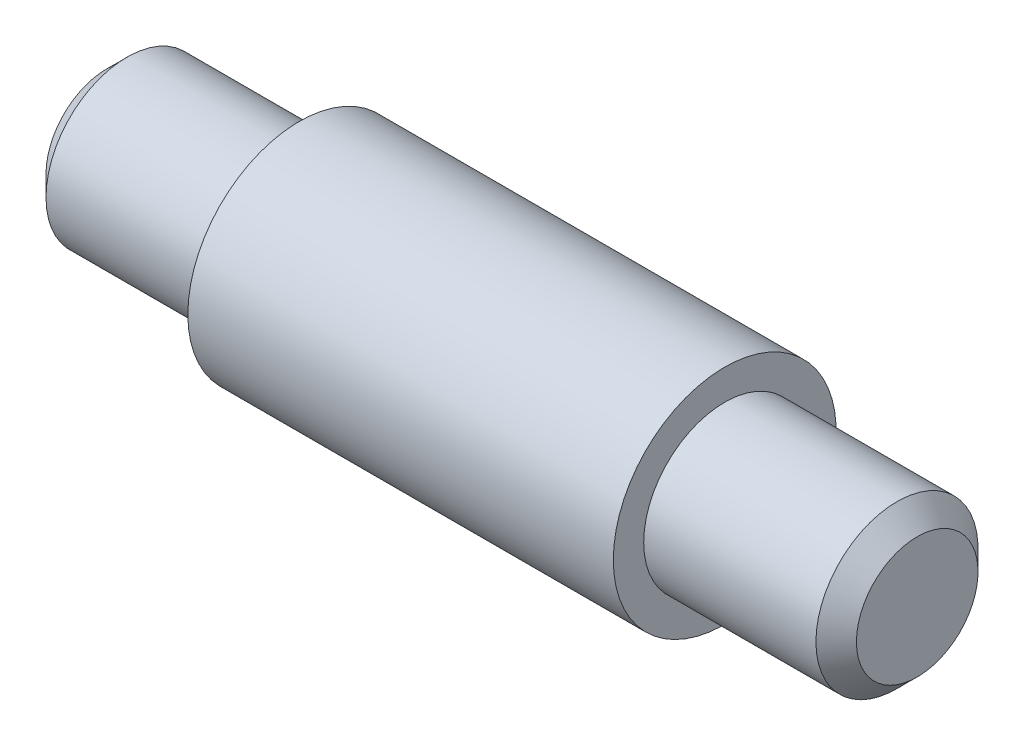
from build123d import *

# Parameters (mm, degrees)
CHAMFER_1_SIZE = 2


with BuildPart() as part:
    # Sketch 1 → Revolve 1 (revolve)
    with BuildSketch(Plane.XY, mode=Mode.PRIVATE) as revolve_1_sk:
        Polygon((0, 0), (0, 11), (21, 11), (21, 8), (40, 8), (40, 0), align=None)
    revolve(revolve_1_sk.sketch.rotate(Axis((0, 0, 0), (1, 0, 0)), 90), axis=Axis((0, 0, 0), (1, 0, 0)))

    # Chamfer 1
    chamfer_1_edges = [part.edges().sort_by_distance(p)[0] for p in [
        (40, 0, -8),
    ]]
    chamfer(chamfer_1_edges, length=CHAMFER_1_SIZE)

    # Mirror 1: part across plane


with BuildPart() as part_1:
    add(part.part)
    add(part.part.mirror(Plane(origin=(0, 0, 0), x_dir=(0, 0, 1), z_dir=(1, 0, 0))))


solid = part_1.part
